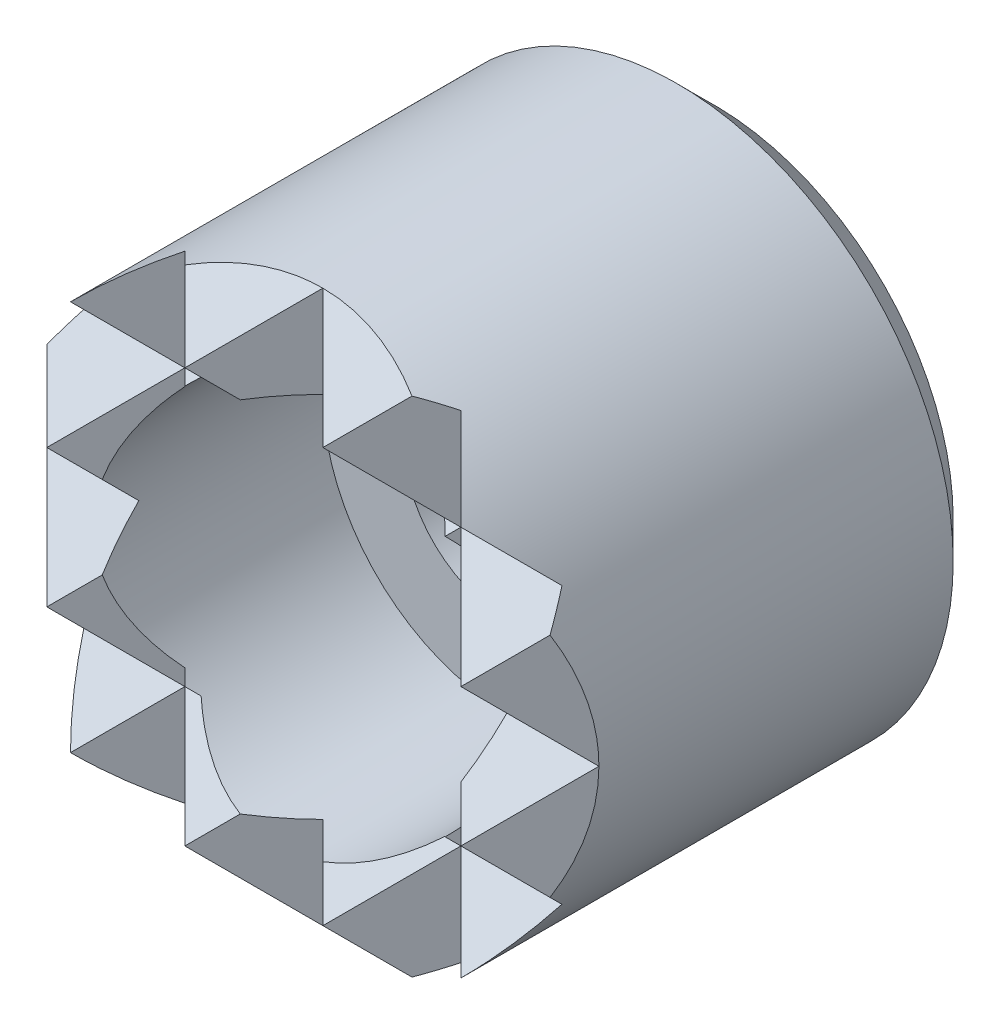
ISO-10303-21;
HEADER;
FILE_DESCRIPTION(('STEP AP214'),'2;1');
FILE_NAME('part.step','',(''),(''),'','','');
FILE_SCHEMA(('AUTOMOTIVE_DESIGN { 1 0 10303 214 1 1 1 1 }'));
ENDSEC;
DATA;
#1=APPLICATION_CONTEXT('core data for automotive mechanical design processes');
#2=APPLICATION_PROTOCOL_DEFINITION('international standard','automotive_design',2000,#1);
#3=PRODUCT_CONTEXT('',#1,'mechanical');
#4=PRODUCT('Part','Part','',(#3));
#5=PRODUCT_RELATED_PRODUCT_CATEGORY('part','',(#4));
#6=PRODUCT_DEFINITION_FORMATION('','',#4);
#7=PRODUCT_DEFINITION_CONTEXT('part definition',#1,'design');
#8=PRODUCT_DEFINITION('design','',#6,#7);
#9=PRODUCT_DEFINITION_SHAPE('','',#8);
#10=(LENGTH_UNIT() NAMED_UNIT(*) SI_UNIT(.MILLI.,.METRE.));
#11=(NAMED_UNIT(*) PLANE_ANGLE_UNIT() SI_UNIT($,.RADIAN.));
#12=(NAMED_UNIT(*) SI_UNIT($,.STERADIAN.) SOLID_ANGLE_UNIT());
#13=UNCERTAINTY_MEASURE_WITH_UNIT(LENGTH_MEASURE(1.E-05),#10,'distance_accuracy_value','');
#14=(GEOMETRIC_REPRESENTATION_CONTEXT(3) GLOBAL_UNCERTAINTY_ASSIGNED_CONTEXT((#13)) GLOBAL_UNIT_ASSIGNED_CONTEXT((#10,
#11,#12)) REPRESENTATION_CONTEXT('',''));
#15=CARTESIAN_POINT('',(0.,0.,0.));
#16=DIRECTION('',(0.,0.,1.));
#17=DIRECTION('',(1.,0.,0.));
#18=AXIS2_PLACEMENT_3D('',#15,#16,#17);
#19=CARTESIAN_POINT('',(-10.,-4.5,10.));
#20=DIRECTION('',(0.,0.707106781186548,-0.707106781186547));
#21=DIRECTION('',(0.,0.707106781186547,0.707106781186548));
#22=AXIS2_PLACEMENT_3D('',#19,#20,#21);
#23=PLANE('',#22);
#24=DIRECTION('',(-0.577350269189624,0.577350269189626,0.577350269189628));
#25=VECTOR('',#24,1.);
#26=CARTESIAN_POINT('',(-4.33333333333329,-1.66666666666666,12.8333333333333));
#27=LINE('',#26,#25);
#28=CARTESIAN_POINT('',(0.,-6.,8.5));
#29=VERTEX_POINT('',#28);
#30=CARTESIAN_POINT('',(-1.49999999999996,-4.5,10.));
#31=VERTEX_POINT('',#30);
#32=EDGE_CURVE('E270',#29,#31,#27,.T.);
#33=ORIENTED_EDGE('',*,*,#32,.T.);
#34=DIRECTION('',(-0.577350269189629,-0.577350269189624,-0.577350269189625));
#35=VECTOR('',#34,1.);
#36=CARTESIAN_POINT('',(-4.33333333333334,-7.33333333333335,7.16666666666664));
#37=LINE('',#36,#35);
#38=CARTESIAN_POINT('',(-2.46862696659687,-5.46862696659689,9.03137303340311));
#39=VERTEX_POINT('',#38);
#40=EDGE_CURVE('E249',#31,#39,#37,.T.);
#41=ORIENTED_EDGE('',*,*,#40,.T.);
#42=CARTESIAN_POINT('',(0.,0.,14.5));
#43=DIRECTION('',(0.,0.707106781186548,-0.707106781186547));
#44=DIRECTION('',(0.,-0.707106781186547,-0.707106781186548));
#45=AXIS2_PLACEMENT_3D('',#42,#43,#44);
#46=ELLIPSE('',#45,8.48528137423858,6.);
#47=EDGE_CURVE('E241',#29,#39,#46,.T.);
#48=ORIENTED_EDGE('',*,*,#47,.F.);
#49=EDGE_LOOP('',(#33,#41,#48));
#50=FACE_BOUND('',#49,.T.);
#51=ADVANCED_FACE('F14',(#50),#23,.F.);
#52=CARTESIAN_POINT('',(-10.,6.,8.5));
#53=DIRECTION('',(0.,-0.707106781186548,-0.707106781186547));
#54=DIRECTION('',(0.,0.707106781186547,-0.707106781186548));
#55=AXIS2_PLACEMENT_3D('',#52,#53,#54);
#56=PLANE('',#55);
#57=CARTESIAN_POINT('',(0.,0.,14.5));
#58=DIRECTION('',(0.,-0.707106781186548,-0.707106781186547));
#59=DIRECTION('',(0.,0.707106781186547,-0.707106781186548));
#60=AXIS2_PLACEMENT_3D('',#57,#58,#59);
#61=ELLIPSE('',#60,8.48528137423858,6.);
#62=CARTESIAN_POINT('',(-2.46862696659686,5.46862696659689,9.03137303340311));
#63=VERTEX_POINT('',#62);
#64=CARTESIAN_POINT('',(0.,6.,8.5));
#65=VERTEX_POINT('',#64);
#66=EDGE_CURVE('E442',#63,#65,#61,.T.);
#67=ORIENTED_EDGE('',*,*,#66,.F.);
#68=DIRECTION('',(0.577350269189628,-0.577350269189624,0.577350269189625));
#69=VECTOR('',#68,1.);
#70=CARTESIAN_POINT('',(-5.33333333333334,8.33333333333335,6.16666666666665));
#71=LINE('',#70,#69);
#72=CARTESIAN_POINT('',(-1.49999999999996,4.5,10.));
#73=VERTEX_POINT('',#72);
#74=EDGE_CURVE('E258',#63,#73,#71,.T.);
#75=ORIENTED_EDGE('',*,*,#74,.T.);
#76=DIRECTION('',(0.577350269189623,0.577350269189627,-0.577350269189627));
#77=VECTOR('',#76,1.);
#78=CARTESIAN_POINT('',(-3.33333333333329,2.66666666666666,11.8333333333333));
#79=LINE('',#78,#77);
#80=EDGE_CURVE('E278',#73,#65,#79,.T.);
#81=ORIENTED_EDGE('',*,*,#80,.T.);
#82=EDGE_LOOP('',(#67,#75,#81));
#83=FACE_BOUND('',#82,.T.);
#84=ADVANCED_FACE('F519',(#83),#56,.F.);
#85=CARTESIAN_POINT('',(-10.,3.,8.5));
#86=DIRECTION('',(0.,-0.707106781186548,-0.707106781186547));
#87=DIRECTION('',(0.,0.707106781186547,-0.707106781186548));
#88=AXIS2_PLACEMENT_3D('',#85,#86,#87);
#89=PLANE('',#88);
#90=CARTESIAN_POINT('',(0.,0.,11.5));
#91=DIRECTION('',(0.,-0.707106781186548,-0.707106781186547));
#92=DIRECTION('',(0.,-0.707106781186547,0.707106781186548));
#93=AXIS2_PLACEMENT_3D('',#90,#91,#92);
#94=ELLIPSE('',#93,5.65685424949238,4.);
#95=CARTESIAN_POINT('',(2.64575131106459,3.,8.5));
#96=VERTEX_POINT('',#95);
#97=CARTESIAN_POINT('',(2.82842712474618,2.8284271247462,8.6715728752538));
#98=VERTEX_POINT('',#97);
#99=EDGE_CURVE('E415',#96,#98,#94,.T.);
#100=ORIENTED_EDGE('',*,*,#99,.T.);
#101=DIRECTION('',(0.577350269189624,0.577350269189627,-0.577350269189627));
#102=VECTOR('',#101,1.);
#103=CARTESIAN_POINT('',(-1.33333333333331,-1.33333333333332,12.8333333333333));
#104=LINE('',#103,#102);
#105=CARTESIAN_POINT('',(3.,3.,8.5));
#106=VERTEX_POINT('',#105);
#107=EDGE_CURVE('E311',#98,#106,#104,.T.);
#108=ORIENTED_EDGE('',*,*,#107,.T.);
#109=DIRECTION('',(1.,0.,0.));
#110=VECTOR('',#109,1.);
#111=CARTESIAN_POINT('',(-10.,3.,8.5));
#112=LINE('',#111,#110);
#113=EDGE_CURVE('E398',#96,#106,#112,.T.);
#114=ORIENTED_EDGE('',*,*,#113,.F.);
#115=EDGE_LOOP('',(#100,#108,#114));
#116=FACE_BOUND('',#115,.T.);
#117=ADVANCED_FACE('F414',(#116),#89,.F.);
#118=CARTESIAN_POINT('',(-2.99999999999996,3.,8.5));
#119=VERTEX_POINT('',#118);
#120=CARTESIAN_POINT('',(-2.64575131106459,3.,8.5));
#121=VERTEX_POINT('',#120);
#122=EDGE_CURVE('E401',#119,#121,#112,.T.);
#123=ORIENTED_EDGE('',*,*,#122,.F.);
#124=DIRECTION('',(0.577350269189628,-0.577350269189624,0.577350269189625));
#125=VECTOR('',#124,1.);
#126=CARTESIAN_POINT('',(-5.33333333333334,5.33333333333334,6.16666666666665));
#127=LINE('',#126,#125);
#128=CARTESIAN_POINT('',(-2.82842712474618,2.8284271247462,8.6715728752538));
#129=VERTEX_POINT('',#128);
#130=EDGE_CURVE('E265',#119,#129,#127,.T.);
#131=ORIENTED_EDGE('',*,*,#130,.T.);
#132=EDGE_CURVE('E417',#129,#121,#94,.T.);
#133=ORIENTED_EDGE('',*,*,#132,.T.);
#134=EDGE_LOOP('',(#123,#131,#133));
#135=FACE_BOUND('',#134,.T.);
#136=ADVANCED_FACE('F660',(#135),#89,.F.);
#137=CARTESIAN_POINT('',(-10.,-1.5,10.));
#138=DIRECTION('',(0.,0.707106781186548,-0.707106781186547));
#139=DIRECTION('',(0.,0.707106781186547,0.707106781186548));
#140=AXIS2_PLACEMENT_3D('',#137,#138,#139);
#141=PLANE('',#140);
#142=CARTESIAN_POINT('',(0.,0.,11.5));
#143=DIRECTION('',(0.,0.707106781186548,-0.707106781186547));
#144=DIRECTION('',(0.,0.707106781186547,0.707106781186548));
#145=AXIS2_PLACEMENT_3D('',#142,#143,#144);
#146=ELLIPSE('',#145,5.65685424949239,4.);
#147=CARTESIAN_POINT('',(-2.64575131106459,-3.,8.5));
#148=VERTEX_POINT('',#147);
#149=CARTESIAN_POINT('',(-2.82842712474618,-2.82842712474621,8.67157287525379));
#150=VERTEX_POINT('',#149);
#151=EDGE_CURVE('E432',#148,#150,#146,.T.);
#152=ORIENTED_EDGE('',*,*,#151,.T.);
#153=DIRECTION('',(-0.577350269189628,-0.577350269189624,-0.577350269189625));
#154=VECTOR('',#153,1.);
#155=CARTESIAN_POINT('',(-4.33333333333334,-4.33333333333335,7.16666666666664));
#156=LINE('',#155,#154);
#157=CARTESIAN_POINT('',(-3.,-3.,8.5));
#158=VERTEX_POINT('',#157);
#159=EDGE_CURVE('E257',#150,#158,#156,.T.);
#160=ORIENTED_EDGE('',*,*,#159,.T.);
#161=DIRECTION('',(1.,0.,0.));
#162=VECTOR('',#161,1.);
#163=CARTESIAN_POINT('',(-10.,-3.,8.5));
#164=LINE('',#163,#162);
#165=EDGE_CURVE('E494',#158,#148,#164,.T.);
#166=ORIENTED_EDGE('',*,*,#165,.T.);
#167=EDGE_LOOP('',(#152,#160,#166));
#168=FACE_BOUND('',#167,.T.);
#169=ADVANCED_FACE('F538',(#168),#141,.F.);
#170=CARTESIAN_POINT('',(2.64575131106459,-3.,8.5));
#171=VERTEX_POINT('',#170);
#172=CARTESIAN_POINT('',(3.,-3.,8.5));
#173=VERTEX_POINT('',#172);
#174=EDGE_CURVE('E491',#171,#173,#164,.T.);
#175=ORIENTED_EDGE('',*,*,#174,.T.);
#176=DIRECTION('',(-0.577350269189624,0.577350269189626,0.577350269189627));
#177=VECTOR('',#176,1.);
#178=CARTESIAN_POINT('',(-2.33333333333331,2.33333333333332,13.8333333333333));
#179=LINE('',#178,#177);
#180=CARTESIAN_POINT('',(2.82842712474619,-2.8284271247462,8.6715728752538));
#181=VERTEX_POINT('',#180);
#182=EDGE_CURVE('E297',#173,#181,#179,.T.);
#183=ORIENTED_EDGE('',*,*,#182,.T.);
#184=EDGE_CURVE('E435',#181,#171,#146,.T.);
#185=ORIENTED_EDGE('',*,*,#184,.T.);
#186=EDGE_LOOP('',(#175,#183,#185));
#187=FACE_BOUND('',#186,.T.);
#188=ADVANCED_FACE('F497',(#187),#141,.F.);
#189=CARTESIAN_POINT('',(-10.,-3.,8.5));
#190=DIRECTION('',(0.,-0.707106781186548,-0.707106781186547));
#191=DIRECTION('',(0.,0.707106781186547,-0.707106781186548));
#192=AXIS2_PLACEMENT_3D('',#189,#190,#191);
#193=PLANE('',#192);
#194=CARTESIAN_POINT('',(0.,0.,5.5));
#195=DIRECTION('',(0.,-0.707106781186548,-0.707106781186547));
#196=DIRECTION('',(0.,-0.707106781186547,0.707106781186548));
#197=AXIS2_PLACEMENT_3D('',#194,#195,#196);
#198=ELLIPSE('',#197,5.65685424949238,4.);
#199=CARTESIAN_POINT('',(0.89791576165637,-3.89791576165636,9.39791576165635));
#200=VERTEX_POINT('',#199);
#201=EDGE_CURVE('E436',#171,#200,#198,.T.);
#202=ORIENTED_EDGE('',*,*,#201,.T.);
#203=DIRECTION('',(0.57735026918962,-0.577350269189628,0.577350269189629));
#204=VECTOR('',#203,1.);
#205=CARTESIAN_POINT('',(-3.33333333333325,0.333333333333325,5.16666666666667));
#206=LINE('',#205,#204);
#207=CARTESIAN_POINT('',(1.5,-4.5,10.));
#208=VERTEX_POINT('',#207);
#209=EDGE_CURVE('E285',#200,#208,#206,.T.);
#210=ORIENTED_EDGE('',*,*,#209,.T.);
#211=DIRECTION('',(0.577350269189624,0.577350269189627,-0.577350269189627));
#212=VECTOR('',#211,1.);
#213=CARTESIAN_POINT('',(-1.33333333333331,-7.33333333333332,12.8333333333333));
#214=LINE('',#213,#212);
#215=EDGE_CURVE('E300',#208,#173,#214,.T.);
#216=ORIENTED_EDGE('',*,*,#215,.T.);
#217=ORIENTED_EDGE('',*,*,#174,.F.);
#218=EDGE_LOOP('',(#202,#210,#216,#217));
#219=FACE_BOUND('',#218,.T.);
#220=ADVANCED_FACE('F500',(#219),#193,.F.);
#221=CARTESIAN_POINT('',(5.19615242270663,-3.,8.5));
#222=VERTEX_POINT('',#221);
#223=EDGE_CURVE('E489',#173,#222,#164,.T.);
#224=ORIENTED_EDGE('',*,*,#223,.F.);
#225=DIRECTION('',(0.577350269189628,-0.577350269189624,0.577350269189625));
#226=VECTOR('',#225,1.);
#227=CARTESIAN_POINT('',(-1.33333333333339,1.33333333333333,4.16666666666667));
#228=LINE('',#227,#226);
#229=CARTESIAN_POINT('',(4.24264068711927,-4.24264068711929,9.74264068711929));
#230=VERTEX_POINT('',#229);
#231=EDGE_CURVE('E322',#173,#230,#228,.T.);
#232=ORIENTED_EDGE('',*,*,#231,.T.);
#233=CARTESIAN_POINT('',(0.,0.,5.5));
#234=DIRECTION('',(0.,-0.707106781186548,-0.707106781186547));
#235=DIRECTION('',(0.,0.707106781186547,-0.707106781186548));
#236=AXIS2_PLACEMENT_3D('',#233,#234,#235);
#237=ELLIPSE('',#236,8.48528137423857,6.);
#238=EDGE_CURVE('E483',#222,#230,#237,.T.);
#239=ORIENTED_EDGE('',*,*,#238,.F.);
#240=EDGE_LOOP('',(#224,#232,#239));
#241=FACE_BOUND('',#240,.T.);
#242=ADVANCED_FACE('F488',(#241),#193,.F.);
#243=DIRECTION('',(0.577350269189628,-0.577350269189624,0.577350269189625));
#244=VECTOR('',#243,1.);
#245=CARTESIAN_POINT('',(-5.33333333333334,-0.666666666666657,6.16666666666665));
#246=LINE('',#245,#244);
#247=EDGE_CURVE('E231',#158,#31,#246,.T.);
#248=ORIENTED_EDGE('',*,*,#247,.T.);
#249=DIRECTION('',(0.577350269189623,0.577350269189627,-0.577350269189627));
#250=VECTOR('',#249,1.);
#251=CARTESIAN_POINT('',(-3.33333333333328,-6.33333333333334,11.8333333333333));
#252=LINE('',#251,#250);
#253=CARTESIAN_POINT('',(-0.897915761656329,-3.89791576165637,9.39791576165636));
#254=VERTEX_POINT('',#253);
#255=EDGE_CURVE('E273',#31,#254,#252,.T.);
#256=ORIENTED_EDGE('',*,*,#255,.T.);
#257=EDGE_CURVE('E440',#254,#148,#198,.T.);
#258=ORIENTED_EDGE('',*,*,#257,.T.);
#259=ORIENTED_EDGE('',*,*,#165,.F.);
#260=EDGE_LOOP('',(#248,#256,#258,#259));
#261=FACE_BOUND('',#260,.T.);
#262=ADVANCED_FACE('F532',(#261),#193,.F.);
#263=CARTESIAN_POINT('',(-10.,4.5,10.));
#264=DIRECTION('',(0.,0.707106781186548,-0.707106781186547));
#265=DIRECTION('',(0.,0.707106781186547,0.707106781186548));
#266=AXIS2_PLACEMENT_3D('',#263,#264,#265);
#267=PLANE('',#266);
#268=DIRECTION('',(-0.577350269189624,0.577350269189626,0.577350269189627));
#269=VECTOR('',#268,1.);
#270=CARTESIAN_POINT('',(-2.33333333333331,8.33333333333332,13.8333333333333));
#271=LINE('',#270,#269);
#272=CARTESIAN_POINT('',(1.5,4.5,10.));
#273=VERTEX_POINT('',#272);
#274=EDGE_CURVE('E388',#106,#273,#271,.T.);
#275=ORIENTED_EDGE('',*,*,#274,.T.);
#276=DIRECTION('',(-0.57735026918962,-0.577350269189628,-0.577350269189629));
#277=VECTOR('',#276,1.);
#278=CARTESIAN_POINT('',(-2.33333333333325,0.666666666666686,6.16666666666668));
#279=LINE('',#278,#277);
#280=CARTESIAN_POINT('',(0.897915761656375,3.89791576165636,9.39791576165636));
#281=VERTEX_POINT('',#280);
#282=EDGE_CURVE('E454',#273,#281,#279,.T.);
#283=ORIENTED_EDGE('',*,*,#282,.T.);
#284=CARTESIAN_POINT('',(0.,0.,5.5));
#285=DIRECTION('',(0.,0.707106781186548,-0.707106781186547));
#286=DIRECTION('',(0.,0.707106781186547,0.707106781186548));
#287=AXIS2_PLACEMENT_3D('',#284,#285,#286);
#288=ELLIPSE('',#287,5.65685424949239,4.);
#289=EDGE_CURVE('E409',#281,#96,#288,.T.);
#290=ORIENTED_EDGE('',*,*,#289,.T.);
#291=ORIENTED_EDGE('',*,*,#113,.T.);
#292=EDGE_LOOP('',(#275,#283,#290,#291));
#293=FACE_BOUND('',#292,.T.);
#294=ADVANCED_FACE('F405',(#293),#267,.F.);
#295=CARTESIAN_POINT('',(0.,0.,5.5));
#296=DIRECTION('',(0.,0.707106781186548,-0.707106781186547));
#297=DIRECTION('',(0.,-0.707106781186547,-0.707106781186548));
#298=AXIS2_PLACEMENT_3D('',#295,#296,#297);
#299=ELLIPSE('',#298,8.48528137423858,6.);
#300=CARTESIAN_POINT('',(4.24264068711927,4.24264068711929,9.7426406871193));
#301=VERTEX_POINT('',#300);
#302=CARTESIAN_POINT('',(5.19615242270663,3.,8.5));
#303=VERTEX_POINT('',#302);
#304=EDGE_CURVE('E386',#301,#303,#299,.T.);
#305=ORIENTED_EDGE('',*,*,#304,.F.);
#306=DIRECTION('',(-0.577350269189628,-0.577350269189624,-0.577350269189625));
#307=VECTOR('',#306,1.);
#308=CARTESIAN_POINT('',(-0.333333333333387,-0.333333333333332,5.16666666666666));
#309=LINE('',#308,#307);
#310=EDGE_CURVE('E381',#301,#106,#309,.T.);
#311=ORIENTED_EDGE('',*,*,#310,.T.);
#312=EDGE_CURVE('E384',#106,#303,#112,.T.);
#313=ORIENTED_EDGE('',*,*,#312,.T.);
#314=EDGE_LOOP('',(#305,#311,#313));
#315=FACE_BOUND('',#314,.T.);
#316=ADVANCED_FACE('F383',(#315),#267,.F.);
#317=CARTESIAN_POINT('',(-0.897915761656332,3.89791576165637,9.39791576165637));
#318=VERTEX_POINT('',#317);
#319=EDGE_CURVE('E418',#121,#318,#288,.T.);
#320=ORIENTED_EDGE('',*,*,#319,.T.);
#321=DIRECTION('',(-0.577350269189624,0.577350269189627,0.577350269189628));
#322=VECTOR('',#321,1.);
#323=CARTESIAN_POINT('',(-4.33333333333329,7.33333333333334,12.8333333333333));
#324=LINE('',#323,#322);
#325=EDGE_CURVE('E389',#318,#73,#324,.T.);
#326=ORIENTED_EDGE('',*,*,#325,.T.);
#327=DIRECTION('',(-0.577350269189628,-0.577350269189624,-0.577350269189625));
#328=VECTOR('',#327,1.);
#329=CARTESIAN_POINT('',(-4.33333333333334,1.66666666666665,7.16666666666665));
#330=LINE('',#329,#328);
#331=EDGE_CURVE('E448',#73,#119,#330,.T.);
#332=ORIENTED_EDGE('',*,*,#331,.T.);
#333=ORIENTED_EDGE('',*,*,#122,.T.);
#334=EDGE_LOOP('',(#320,#326,#332,#333));
#335=FACE_BOUND('',#334,.T.);
#336=ADVANCED_FACE('F602',(#335),#267,.F.);
#337=CARTESIAN_POINT('',(0.,0.,0.));
#338=DIRECTION('',(0.,0.,1.));
#339=DIRECTION('',(1.,0.,0.));
#340=AXIS2_PLACEMENT_3D('',#337,#338,#339);
#341=PLANE('',#340);
#342=CARTESIAN_POINT('',(0.,0.,0.));
#343=DIRECTION('',(0.,0.,1.));
#344=DIRECTION('',(1.,0.,0.));
#345=AXIS2_PLACEMENT_3D('',#342,#343,#344);
#346=CIRCLE('',#345,5.2);
#347=CARTESIAN_POINT('',(5.2,0.,0.));
#348=VERTEX_POINT('',#347);
#349=EDGE_CURVE('E585',#348,#348,#346,.F.);
#350=ORIENTED_EDGE('',*,*,#349,.T.);
#351=EDGE_LOOP('',(#350));
#352=FACE_BOUND('',#351,.T.);
#353=CARTESIAN_POINT('',(0.,0.,0.));
#354=DIRECTION('',(0.,0.,1.));
#355=DIRECTION('',(1.,0.,0.));
#356=AXIS2_PLACEMENT_3D('',#353,#354,#355);
#357=CIRCLE('',#356,2.25);
#358=CARTESIAN_POINT('',(2.25,0.,0.));
#359=VERTEX_POINT('',#358);
#360=EDGE_CURVE('E580',#359,#359,#357,.F.);
#361=ORIENTED_EDGE('',*,*,#360,.F.);
#362=EDGE_LOOP('',(#361));
#363=FACE_BOUND('',#362,.T.);
#364=ADVANCED_FACE('F589',(#352,#363),#341,.F.);
#365=CARTESIAN_POINT('',(0.,0.,10.));
#366=DIRECTION('',(0.,0.,-1.));
#367=DIRECTION('',(-1.,0.,0.));
#368=AXIS2_PLACEMENT_3D('',#365,#366,#367);
#369=CYLINDRICAL_SURFACE('',#368,6.);
#370=CARTESIAN_POINT('',(0.,0.,0.8));
#371=DIRECTION('',(0.,0.,1.));
#372=DIRECTION('',(1.,0.,0.));
#373=AXIS2_PLACEMENT_3D('',#370,#371,#372);
#374=CIRCLE('',#373,6.);
#375=CARTESIAN_POINT('',(6.,0.,0.8));
#376=VERTEX_POINT('',#375);
#377=EDGE_CURVE('E583',#376,#376,#374,.T.);
#378=ORIENTED_EDGE('',*,*,#377,.T.);
#379=EDGE_LOOP('',(#378));
#380=FACE_BOUND('',#379,.T.);
#381=CARTESIAN_POINT('',(2.46862696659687,5.46862696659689,9.03137303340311));
#382=VERTEX_POINT('',#381);
#383=EDGE_CURVE('E439',#65,#382,#61,.T.);
#384=ORIENTED_EDGE('',*,*,#383,.T.);
#385=CARTESIAN_POINT('',(0.,0.,11.5));
#386=DIRECTION('',(-0.70710678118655,0.,-0.707106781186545));
#387=DIRECTION('',(0.707106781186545,0.,-0.70710678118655));
#388=AXIS2_PLACEMENT_3D('',#385,#386,#387);
#389=ELLIPSE('',#388,8.4852813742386,6.);
#390=CARTESIAN_POINT('',(3.,5.19615242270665,8.5));
#391=VERTEX_POINT('',#390);
#392=EDGE_CURVE('E303',#382,#391,#389,.T.);
#393=ORIENTED_EDGE('',*,*,#392,.T.);
#394=CARTESIAN_POINT('',(0.,0.,5.5));
#395=DIRECTION('',(0.707106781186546,0.,-0.70710678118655));
#396=DIRECTION('',(-0.70710678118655,0.,-0.707106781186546));
#397=AXIS2_PLACEMENT_3D('',#394,#395,#396);
#398=ELLIPSE('',#397,8.48528137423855,6.);
#399=EDGE_CURVE('E330',#391,#301,#398,.T.);
#400=ORIENTED_EDGE('',*,*,#399,.T.);
#401=ORIENTED_EDGE('',*,*,#304,.T.);
#402=CARTESIAN_POINT('',(0.,0.,11.5));
#403=DIRECTION('',(0.,-0.707106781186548,-0.707106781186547));
#404=DIRECTION('',(0.,0.707106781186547,-0.707106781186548));
#405=AXIS2_PLACEMENT_3D('',#402,#403,#404);
#406=ELLIPSE('',#405,8.48528137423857,6.);
#407=CARTESIAN_POINT('',(5.46862696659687,2.46862696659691,9.03137303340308));
#408=VERTEX_POINT('',#407);
#409=EDGE_CURVE('E397',#303,#408,#406,.T.);
#410=ORIENTED_EDGE('',*,*,#409,.T.);
#411=CARTESIAN_POINT('',(0.,0.,14.5));
#412=DIRECTION('',(-0.70710678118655,0.,-0.707106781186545));
#413=DIRECTION('',(0.707106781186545,0.,-0.70710678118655));
#414=AXIS2_PLACEMENT_3D('',#411,#412,#413);
#415=ELLIPSE('',#414,8.4852813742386,6.);
#416=CARTESIAN_POINT('',(6.,0.,8.5));
#417=VERTEX_POINT('',#416);
#418=EDGE_CURVE('E548',#408,#417,#415,.T.);
#419=ORIENTED_EDGE('',*,*,#418,.T.);
#420=CARTESIAN_POINT('',(5.46862696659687,-2.46862696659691,9.03137303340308));
#421=VERTEX_POINT('',#420);
#422=EDGE_CURVE('E551',#417,#421,#415,.T.);
#423=ORIENTED_EDGE('',*,*,#422,.T.);
#424=CARTESIAN_POINT('',(0.,0.,11.5));
#425=DIRECTION('',(0.,0.707106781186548,-0.707106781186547));
#426=DIRECTION('',(0.,-0.707106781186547,-0.707106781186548));
#427=AXIS2_PLACEMENT_3D('',#424,#425,#426);
#428=ELLIPSE('',#427,8.48528137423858,6.);
#429=EDGE_CURVE('E462',#421,#222,#428,.T.);
#430=ORIENTED_EDGE('',*,*,#429,.T.);
#431=ORIENTED_EDGE('',*,*,#238,.T.);
#432=CARTESIAN_POINT('',(3.,-5.19615242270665,8.5));
#433=VERTEX_POINT('',#432);
#434=EDGE_CURVE('E314',#230,#433,#398,.T.);
#435=ORIENTED_EDGE('',*,*,#434,.T.);
#436=CARTESIAN_POINT('',(2.46862696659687,-5.46862696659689,9.03137303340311));
#437=VERTEX_POINT('',#436);
#438=EDGE_CURVE('E292',#433,#437,#389,.T.);
#439=ORIENTED_EDGE('',*,*,#438,.T.);
#440=EDGE_CURVE('E444',#437,#29,#46,.T.);
#441=ORIENTED_EDGE('',*,*,#440,.T.);
#442=ORIENTED_EDGE('',*,*,#47,.T.);
#443=CARTESIAN_POINT('',(0.,0.,11.5));
#444=DIRECTION('',(0.707106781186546,0.,-0.70710678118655));
#445=DIRECTION('',(-0.70710678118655,0.,-0.707106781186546));
#446=AXIS2_PLACEMENT_3D('',#443,#444,#445);
#447=ELLIPSE('',#446,8.48528137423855,6.);
#448=CARTESIAN_POINT('',(-3.,-5.19615242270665,8.5));
#449=VERTEX_POINT('',#448);
#450=EDGE_CURVE('E228',#39,#449,#447,.T.);
#451=ORIENTED_EDGE('',*,*,#450,.T.);
#452=CARTESIAN_POINT('',(0.,0.,5.5));
#453=DIRECTION('',(-0.70710678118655,0.,-0.707106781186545));
#454=DIRECTION('',(0.707106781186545,0.,-0.70710678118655));
#455=AXIS2_PLACEMENT_3D('',#452,#453,#454);
#456=ELLIPSE('',#455,8.4852813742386,6.);
#457=CARTESIAN_POINT('',(-4.24264068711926,-4.24264068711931,9.74264068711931));
#458=VERTEX_POINT('',#457);
#459=EDGE_CURVE('E211',#449,#458,#456,.T.);
#460=ORIENTED_EDGE('',*,*,#459,.T.);
#461=CARTESIAN_POINT('',(-5.19615242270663,-3.,8.5));
#462=VERTEX_POINT('',#461);
#463=EDGE_CURVE('E568',#458,#462,#237,.T.);
#464=ORIENTED_EDGE('',*,*,#463,.T.);
#465=CARTESIAN_POINT('',(-5.46862696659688,-2.46862696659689,9.03137303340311));
#466=VERTEX_POINT('',#465);
#467=EDGE_CURVE('E571',#462,#466,#428,.T.);
#468=ORIENTED_EDGE('',*,*,#467,.T.);
#469=CARTESIAN_POINT('',(0.,0.,14.5));
#470=DIRECTION('',(0.707106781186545,0.,-0.70710678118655));
#471=DIRECTION('',(-0.70710678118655,0.,-0.707106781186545));
#472=AXIS2_PLACEMENT_3D('',#469,#470,#471);
#473=ELLIPSE('',#472,8.48528137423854,6.);
#474=CARTESIAN_POINT('',(-6.,0.,8.5));
#475=VERTEX_POINT('',#474);
#476=EDGE_CURVE('E559',#466,#475,#473,.T.);
#477=ORIENTED_EDGE('',*,*,#476,.T.);
#478=CARTESIAN_POINT('',(-5.46862696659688,2.46862696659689,9.03137303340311));
#479=VERTEX_POINT('',#478);
#480=EDGE_CURVE('E399',#475,#479,#473,.T.);
#481=ORIENTED_EDGE('',*,*,#480,.T.);
#482=CARTESIAN_POINT('',(-5.19615242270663,3.,8.5));
#483=VERTEX_POINT('',#482);
#484=EDGE_CURVE('E572',#479,#483,#406,.T.);
#485=ORIENTED_EDGE('',*,*,#484,.T.);
#486=CARTESIAN_POINT('',(-4.24264068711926,4.24264068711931,9.74264068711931));
#487=VERTEX_POINT('',#486);
#488=EDGE_CURVE('E567',#483,#487,#299,.T.);
#489=ORIENTED_EDGE('',*,*,#488,.T.);
#490=CARTESIAN_POINT('',(-3.,5.19615242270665,8.5));
#491=VERTEX_POINT('',#490);
#492=EDGE_CURVE('E224',#487,#491,#456,.T.);
#493=ORIENTED_EDGE('',*,*,#492,.T.);
#494=EDGE_CURVE('E245',#491,#63,#447,.T.);
#495=ORIENTED_EDGE('',*,*,#494,.T.);
#496=ORIENTED_EDGE('',*,*,#66,.T.);
#497=EDGE_LOOP('',(#384,#393,#400,#401,#410,#419,#423,#430,#431,#435,#439,#441,#442,#451,#460,
#464,#468,#477,#481,#485,#489,#493,#495,#496));
#498=FACE_BOUND('',#497,.T.);
#499=ADVANCED_FACE('F238',(#380,#498),#369,.T.);
#500=CARTESIAN_POINT('',(0.,0.,10.));
#501=DIRECTION('',(0.,0.,1.));
#502=DIRECTION('',(1.,0.,0.));
#503=AXIS2_PLACEMENT_3D('',#500,#501,#502);
#504=CYLINDRICAL_SURFACE('',#503,2.25);
#505=CARTESIAN_POINT('',(0.,0.,4.5));
#506=DIRECTION('',(0.,0.,1.));
#507=DIRECTION('',(1.,0.,0.));
#508=AXIS2_PLACEMENT_3D('',#505,#506,#507);
#509=CIRCLE('',#508,2.25);
#510=CARTESIAN_POINT('',(2.25,0.,4.5));
#511=VERTEX_POINT('',#510);
#512=EDGE_CURVE('E574',#511,#511,#509,.T.);
#513=ORIENTED_EDGE('',*,*,#512,.T.);
#514=EDGE_LOOP('',(#513));
#515=FACE_BOUND('',#514,.T.);
#516=ORIENTED_EDGE('',*,*,#360,.T.);
#517=EDGE_LOOP('',(#516));
#518=FACE_BOUND('',#517,.T.);
#519=ADVANCED_FACE('F595',(#515,#518),#504,.F.);
#520=CARTESIAN_POINT('',(0.,0.,10.));
#521=DIRECTION('',(0.,0.,1.));
#522=DIRECTION('',(1.,0.,0.));
#523=AXIS2_PLACEMENT_3D('',#520,#521,#522);
#524=CYLINDRICAL_SURFACE('',#523,4.);
#525=CARTESIAN_POINT('',(0.,0.,8.5));
#526=DIRECTION('',(-0.70710678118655,0.,-0.707106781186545));
#527=DIRECTION('',(-0.707106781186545,0.,0.70710678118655));
#528=AXIS2_PLACEMENT_3D('',#525,#526,#527);
#529=ELLIPSE('',#528,5.6568542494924,4.);
#530=CARTESIAN_POINT('',(0.,-4.,8.5));
#531=VERTEX_POINT('',#530);
#532=EDGE_CURVE('E269',#531,#254,#529,.T.);
#533=ORIENTED_EDGE('',*,*,#532,.F.);
#534=CARTESIAN_POINT('',(0.,0.,8.5));
#535=DIRECTION('',(0.707106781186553,0.,-0.707106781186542));
#536=DIRECTION('',(0.707106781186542,0.,0.707106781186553));
#537=AXIS2_PLACEMENT_3D('',#534,#535,#536);
#538=ELLIPSE('',#537,5.65685424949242,4.);
#539=EDGE_CURVE('E281',#200,#531,#538,.T.);
#540=ORIENTED_EDGE('',*,*,#539,.F.);
#541=ORIENTED_EDGE('',*,*,#201,.F.);
#542=ORIENTED_EDGE('',*,*,#184,.F.);
#543=CARTESIAN_POINT('',(0.,0.,11.5));
#544=DIRECTION('',(-0.70710678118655,0.,-0.707106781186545));
#545=DIRECTION('',(-0.707106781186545,0.,0.70710678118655));
#546=AXIS2_PLACEMENT_3D('',#543,#544,#545);
#547=ELLIPSE('',#546,5.6568542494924,4.);
#548=CARTESIAN_POINT('',(3.,-2.64575131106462,8.5));
#549=VERTEX_POINT('',#548);
#550=EDGE_CURVE('E296',#549,#181,#547,.T.);
#551=ORIENTED_EDGE('',*,*,#550,.F.);
#552=CARTESIAN_POINT('',(0.,0.,5.5));
#553=DIRECTION('',(0.707106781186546,0.,-0.70710678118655));
#554=DIRECTION('',(0.70710678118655,0.,0.707106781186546));
#555=AXIS2_PLACEMENT_3D('',#552,#553,#554);
#556=ELLIPSE('',#555,5.65685424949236,4.);
#557=CARTESIAN_POINT('',(3.89791576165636,-0.897915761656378,9.39791576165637));
#558=VERTEX_POINT('',#557);
#559=EDGE_CURVE('E318',#558,#549,#556,.T.);
#560=ORIENTED_EDGE('',*,*,#559,.F.);
#561=CARTESIAN_POINT('',(0.,0.,8.5));
#562=DIRECTION('',(0.,-0.707106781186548,-0.707106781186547));
#563=DIRECTION('',(0.,-0.707106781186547,0.707106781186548));
#564=AXIS2_PLACEMENT_3D('',#561,#562,#563);
#565=ELLIPSE('',#564,5.65685424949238,4.);
#566=CARTESIAN_POINT('',(4.,0.,8.5));
#567=VERTEX_POINT('',#566);
#568=EDGE_CURVE('E428',#567,#558,#565,.T.);
#569=ORIENTED_EDGE('',*,*,#568,.F.);
#570=CARTESIAN_POINT('',(0.,0.,8.5));
#571=DIRECTION('',(0.,0.707106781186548,-0.707106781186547));
#572=DIRECTION('',(0.,0.707106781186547,0.707106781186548));
#573=AXIS2_PLACEMENT_3D('',#570,#571,#572);
#574=ELLIPSE('',#573,5.65685424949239,4.);
#575=CARTESIAN_POINT('',(3.89791576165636,0.897915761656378,9.39791576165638));
#576=VERTEX_POINT('',#575);
#577=EDGE_CURVE('E427',#576,#567,#574,.T.);
#578=ORIENTED_EDGE('',*,*,#577,.F.);
#579=CARTESIAN_POINT('',(3.,2.64575131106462,8.5));
#580=VERTEX_POINT('',#579);
#581=EDGE_CURVE('E325',#580,#576,#556,.T.);
#582=ORIENTED_EDGE('',*,*,#581,.F.);
#583=EDGE_CURVE('E306',#98,#580,#547,.T.);
#584=ORIENTED_EDGE('',*,*,#583,.F.);
#585=ORIENTED_EDGE('',*,*,#99,.F.);
#586=ORIENTED_EDGE('',*,*,#289,.F.);
#587=CARTESIAN_POINT('',(0.,4.,8.5));
#588=VERTEX_POINT('',#587);
#589=EDGE_CURVE('E288',#588,#281,#538,.T.);
#590=ORIENTED_EDGE('',*,*,#589,.F.);
#591=EDGE_CURVE('E276',#318,#588,#529,.T.);
#592=ORIENTED_EDGE('',*,*,#591,.F.);
#593=ORIENTED_EDGE('',*,*,#319,.F.);
#594=ORIENTED_EDGE('',*,*,#132,.F.);
#595=CARTESIAN_POINT('',(0.,0.,11.5));
#596=DIRECTION('',(0.707106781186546,0.,-0.70710678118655));
#597=DIRECTION('',(0.70710678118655,0.,0.707106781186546));
#598=AXIS2_PLACEMENT_3D('',#595,#596,#597);
#599=ELLIPSE('',#598,5.65685424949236,4.);
#600=CARTESIAN_POINT('',(-3.,2.64575131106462,8.5));
#601=VERTEX_POINT('',#600);
#602=EDGE_CURVE('E251',#601,#129,#599,.T.);
#603=ORIENTED_EDGE('',*,*,#602,.F.);
#604=CARTESIAN_POINT('',(0.,0.,5.5));
#605=DIRECTION('',(-0.70710678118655,0.,-0.707106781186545));
#606=DIRECTION('',(-0.707106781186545,0.,0.70710678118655));
#607=AXIS2_PLACEMENT_3D('',#604,#605,#606);
#608=ELLIPSE('',#607,5.6568542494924,4.);
#609=CARTESIAN_POINT('',(-3.89791576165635,0.897915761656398,9.3979157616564));
#610=VERTEX_POINT('',#609);
#611=EDGE_CURVE('E340',#610,#601,#608,.T.);
#612=ORIENTED_EDGE('',*,*,#611,.F.);
#613=CARTESIAN_POINT('',(-4.,0.,8.5));
#614=VERTEX_POINT('',#613);
#615=EDGE_CURVE('E420',#614,#610,#574,.T.);
#616=ORIENTED_EDGE('',*,*,#615,.F.);
#617=CARTESIAN_POINT('',(-3.89791576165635,-0.897915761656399,9.3979157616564));
#618=VERTEX_POINT('',#617);
#619=EDGE_CURVE('E431',#618,#614,#565,.T.);
#620=ORIENTED_EDGE('',*,*,#619,.F.);
#621=CARTESIAN_POINT('',(-3.,-2.64575131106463,8.5));
#622=VERTEX_POINT('',#621);
#623=EDGE_CURVE('E222',#622,#618,#608,.T.);
#624=ORIENTED_EDGE('',*,*,#623,.F.);
#625=EDGE_CURVE('E243',#150,#622,#599,.T.);
#626=ORIENTED_EDGE('',*,*,#625,.F.);
#627=ORIENTED_EDGE('',*,*,#151,.F.);
#628=ORIENTED_EDGE('',*,*,#257,.F.);
#629=EDGE_LOOP('',(#533,#540,#541,#542,#551,#560,#569,#578,#582,#584,#585,#586,#590,#592,#593,
#594,#603,#612,#616,#620,#624,#626,#627,#628));
#630=FACE_BOUND('',#629,.T.);
#631=CARTESIAN_POINT('',(0.,0.,4.5));
#632=DIRECTION('',(0.,0.,1.));
#633=DIRECTION('',(1.,0.,0.));
#634=AXIS2_PLACEMENT_3D('',#631,#632,#633);
#635=CIRCLE('',#634,4.);
#636=CARTESIAN_POINT('',(4.,0.,4.5));
#637=VERTEX_POINT('',#636);
#638=EDGE_CURVE('E577',#637,#637,#635,.T.);
#639=ORIENTED_EDGE('',*,*,#638,.F.);
#640=EDGE_LOOP('',(#639));
#641=FACE_BOUND('',#640,.T.);
#642=ADVANCED_FACE('F474',(#630,#641),#524,.F.);
#643=CARTESIAN_POINT('',(2.25,0.,4.5));
#644=DIRECTION('',(0.,0.,1.));
#645=DIRECTION('',(1.,0.,0.));
#646=AXIS2_PLACEMENT_3D('',#643,#644,#645);
#647=PLANE('',#646);
#648=ORIENTED_EDGE('',*,*,#638,.T.);
#649=EDGE_LOOP('',(#648));
#650=FACE_BOUND('',#649,.T.);
#651=ORIENTED_EDGE('',*,*,#512,.F.);
#652=EDGE_LOOP('',(#651));
#653=FACE_BOUND('',#652,.T.);
#654=ADVANCED_FACE('F520',(#650,#653),#647,.T.);
#655=CARTESIAN_POINT('',(0.,0.,0.8));
#656=DIRECTION('',(0.,0.,1.));
#657=DIRECTION('',(1.,0.,0.));
#658=AXIS2_PLACEMENT_3D('',#655,#656,#657);
#659=CONICAL_SURFACE('',#658,6.,0.78539816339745);
#660=ORIENTED_EDGE('',*,*,#349,.F.);
#661=EDGE_LOOP('',(#660));
#662=FACE_BOUND('',#661,.T.);
#663=ORIENTED_EDGE('',*,*,#377,.F.);
#664=EDGE_LOOP('',(#663));
#665=FACE_BOUND('',#664,.T.);
#666=ADVANCED_FACE('F16',(#662,#665),#659,.T.);
#667=DIRECTION('',(-0.577350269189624,0.577350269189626,0.577350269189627));
#668=VECTOR('',#667,1.);
#669=CARTESIAN_POINT('',(-2.33333333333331,-0.66666666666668,13.8333333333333));
#670=LINE('',#669,#668);
#671=EDGE_CURVE('E293',#437,#208,#670,.T.);
#672=ORIENTED_EDGE('',*,*,#671,.T.);
#673=DIRECTION('',(-0.577350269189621,-0.577350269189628,-0.577350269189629));
#674=VECTOR('',#673,1.);
#675=CARTESIAN_POINT('',(-2.33333333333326,-8.33333333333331,6.16666666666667));
#676=LINE('',#675,#674);
#677=EDGE_CURVE('E282',#208,#29,#676,.T.);
#678=ORIENTED_EDGE('',*,*,#677,.T.);
#679=ORIENTED_EDGE('',*,*,#440,.F.);
#680=EDGE_LOOP('',(#672,#678,#679));
#681=FACE_BOUND('',#680,.T.);
#682=ADVANCED_FACE('F508',(#681),#23,.F.);
#683=ORIENTED_EDGE('',*,*,#383,.F.);
#684=DIRECTION('',(0.57735026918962,-0.577350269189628,0.577350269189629));
#685=VECTOR('',#684,1.);
#686=CARTESIAN_POINT('',(-3.33333333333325,9.33333333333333,5.16666666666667));
#687=LINE('',#686,#685);
#688=EDGE_CURVE('E290',#65,#273,#687,.T.);
#689=ORIENTED_EDGE('',*,*,#688,.T.);
#690=DIRECTION('',(0.577350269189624,0.577350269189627,-0.577350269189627));
#691=VECTOR('',#690,1.);
#692=CARTESIAN_POINT('',(-1.33333333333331,1.66666666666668,12.8333333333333));
#693=LINE('',#692,#691);
#694=EDGE_CURVE('E308',#273,#382,#693,.T.);
#695=ORIENTED_EDGE('',*,*,#694,.T.);
#696=EDGE_LOOP('',(#683,#689,#695));
#697=FACE_BOUND('',#696,.T.);
#698=ADVANCED_FACE('F510',(#697),#56,.F.);
#699=ORIENTED_EDGE('',*,*,#312,.F.);
#700=DIRECTION('',(0.577350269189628,-0.577350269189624,0.577350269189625));
#701=VECTOR('',#700,1.);
#702=CARTESIAN_POINT('',(-1.33333333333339,7.33333333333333,4.16666666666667));
#703=LINE('',#702,#701);
#704=CARTESIAN_POINT('',(4.5,1.49999999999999,10.));
#705=VERTEX_POINT('',#704);
#706=EDGE_CURVE('E221',#106,#705,#703,.T.);
#707=ORIENTED_EDGE('',*,*,#706,.T.);
#708=DIRECTION('',(0.577350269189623,0.577350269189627,-0.577350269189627));
#709=VECTOR('',#708,1.);
#710=CARTESIAN_POINT('',(0.66666666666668,-2.33333333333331,13.8333333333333));
#711=LINE('',#710,#709);
#712=EDGE_CURVE('E546',#705,#408,#711,.T.);
#713=ORIENTED_EDGE('',*,*,#712,.T.);
#714=ORIENTED_EDGE('',*,*,#409,.F.);
#715=EDGE_LOOP('',(#699,#707,#713,#714));
#716=FACE_BOUND('',#715,.T.);
#717=ADVANCED_FACE('F393',(#716),#89,.F.);
#718=ORIENTED_EDGE('',*,*,#484,.F.);
#719=DIRECTION('',(0.577350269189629,-0.577350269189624,0.577350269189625));
#720=VECTOR('',#719,1.);
#721=CARTESIAN_POINT('',(-7.33333333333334,4.33333333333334,7.16666666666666));
#722=LINE('',#721,#720);
#723=CARTESIAN_POINT('',(-4.5,1.5,10.));
#724=VERTEX_POINT('',#723);
#725=EDGE_CURVE('E556',#479,#724,#722,.T.);
#726=ORIENTED_EDGE('',*,*,#725,.T.);
#727=DIRECTION('',(0.577350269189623,0.577350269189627,-0.577350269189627));
#728=VECTOR('',#727,1.);
#729=CARTESIAN_POINT('',(-5.33333333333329,0.666666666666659,10.8333333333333));
#730=LINE('',#729,#728);
#731=EDGE_CURVE('E345',#724,#119,#730,.T.);
#732=ORIENTED_EDGE('',*,*,#731,.T.);
#733=EDGE_CURVE('E413',#483,#119,#112,.T.);
#734=ORIENTED_EDGE('',*,*,#733,.F.);
#735=EDGE_LOOP('',(#718,#726,#732,#734));
#736=FACE_BOUND('',#735,.T.);
#737=ADVANCED_FACE('F612',(#736),#89,.F.);
#738=CARTESIAN_POINT('',(-10.,1.5,10.));
#739=DIRECTION('',(0.,0.707106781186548,-0.707106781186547));
#740=DIRECTION('',(0.,0.707106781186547,0.707106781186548));
#741=AXIS2_PLACEMENT_3D('',#738,#739,#740);
#742=PLANE('',#741);
#743=DIRECTION('',(-0.577350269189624,0.577350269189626,0.577350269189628));
#744=VECTOR('',#743,1.);
#745=CARTESIAN_POINT('',(-6.33333333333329,3.33333333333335,11.8333333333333));
#746=LINE('',#745,#744);
#747=EDGE_CURVE('E342',#610,#724,#746,.T.);
#748=ORIENTED_EDGE('',*,*,#747,.T.);
#749=DIRECTION('',(-0.577350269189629,-0.577350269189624,-0.577350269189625));
#750=VECTOR('',#749,1.);
#751=CARTESIAN_POINT('',(-6.33333333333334,-0.333333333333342,8.16666666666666));
#752=LINE('',#751,#750);
#753=EDGE_CURVE('E553',#724,#475,#752,.T.);
#754=ORIENTED_EDGE('',*,*,#753,.T.);
#755=DIRECTION('',(1.,0.,0.));
#756=VECTOR('',#755,1.);
#757=CARTESIAN_POINT('',(-10.,0.,8.5));
#758=LINE('',#757,#756);
#759=EDGE_CURVE('E564',#475,#614,#758,.T.);
#760=ORIENTED_EDGE('',*,*,#759,.T.);
#761=ORIENTED_EDGE('',*,*,#615,.T.);
#762=EDGE_LOOP('',(#748,#754,#760,#761));
#763=FACE_BOUND('',#762,.T.);
#764=ADVANCED_FACE('F669',(#763),#742,.F.);
#765=DIRECTION('',(-0.577350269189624,0.577350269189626,0.577350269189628));
#766=VECTOR('',#765,1.);
#767=CARTESIAN_POINT('',(-0.333333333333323,6.33333333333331,14.8333333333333));
#768=LINE('',#767,#766);
#769=EDGE_CURVE('E247',#417,#705,#768,.T.);
#770=ORIENTED_EDGE('',*,*,#769,.T.);
#771=DIRECTION('',(-0.577350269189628,-0.577350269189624,-0.577350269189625));
#772=VECTOR('',#771,1.);
#773=CARTESIAN_POINT('',(-0.33333333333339,-3.33333333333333,5.16666666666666));
#774=LINE('',#773,#772);
#775=EDGE_CURVE('E327',#705,#576,#774,.T.);
#776=ORIENTED_EDGE('',*,*,#775,.T.);
#777=ORIENTED_EDGE('',*,*,#577,.T.);
#778=EDGE_CURVE('E562',#567,#417,#758,.T.);
#779=ORIENTED_EDGE('',*,*,#778,.T.);
#780=EDGE_LOOP('',(#770,#776,#777,#779));
#781=FACE_BOUND('',#780,.T.);
#782=ADVANCED_FACE('F685',(#781),#742,.F.);
#783=CARTESIAN_POINT('',(-10.,0.,8.5));
#784=DIRECTION('',(0.,-0.707106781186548,-0.707106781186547));
#785=DIRECTION('',(0.,0.707106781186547,-0.707106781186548));
#786=AXIS2_PLACEMENT_3D('',#783,#784,#785);
#787=PLANE('',#786);
#788=ORIENTED_EDGE('',*,*,#568,.T.);
#789=DIRECTION('',(0.577350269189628,-0.577350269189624,0.577350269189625));
#790=VECTOR('',#789,1.);
#791=CARTESIAN_POINT('',(-1.33333333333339,4.33333333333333,4.16666666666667));
#792=LINE('',#791,#790);
#793=CARTESIAN_POINT('',(4.5,-1.5,10.));
#794=VERTEX_POINT('',#793);
#795=EDGE_CURVE('E315',#558,#794,#792,.T.);
#796=ORIENTED_EDGE('',*,*,#795,.T.);
#797=DIRECTION('',(0.577350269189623,0.577350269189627,-0.577350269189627));
#798=VECTOR('',#797,1.);
#799=CARTESIAN_POINT('',(0.66666666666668,-5.3333333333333,13.8333333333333));
#800=LINE('',#799,#798);
#801=EDGE_CURVE('E242',#794,#417,#800,.T.);
#802=ORIENTED_EDGE('',*,*,#801,.T.);
#803=ORIENTED_EDGE('',*,*,#778,.F.);
#804=EDGE_LOOP('',(#788,#796,#802,#803));
#805=FACE_BOUND('',#804,.T.);
#806=ADVANCED_FACE('F467',(#805),#787,.F.);
#807=ORIENTED_EDGE('',*,*,#759,.F.);
#808=DIRECTION('',(0.577350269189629,-0.577350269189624,0.577350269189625));
#809=VECTOR('',#808,1.);
#810=CARTESIAN_POINT('',(-7.33333333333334,1.33333333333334,7.16666666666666));
#811=LINE('',#810,#809);
#812=CARTESIAN_POINT('',(-4.5,-1.49999999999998,10.));
#813=VERTEX_POINT('',#812);
#814=EDGE_CURVE('E29',#475,#813,#811,.T.);
#815=ORIENTED_EDGE('',*,*,#814,.T.);
#816=DIRECTION('',(0.577350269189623,0.577350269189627,-0.577350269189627));
#817=VECTOR('',#816,1.);
#818=CARTESIAN_POINT('',(-5.33333333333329,-2.33333333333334,10.8333333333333));
#819=LINE('',#818,#817);
#820=EDGE_CURVE('E37',#813,#618,#819,.T.);
#821=ORIENTED_EDGE('',*,*,#820,.T.);
#822=ORIENTED_EDGE('',*,*,#619,.T.);
#823=EDGE_LOOP('',(#807,#815,#821,#822));
#824=FACE_BOUND('',#823,.T.);
#825=ADVANCED_FACE('F675',(#824),#787,.F.);
#826=DIRECTION('',(-0.577350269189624,0.577350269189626,0.577350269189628));
#827=VECTOR('',#826,1.);
#828=CARTESIAN_POINT('',(-6.33333333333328,0.333333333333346,11.8333333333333));
#829=LINE('',#828,#827);
#830=EDGE_CURVE('E336',#158,#813,#829,.T.);
#831=ORIENTED_EDGE('',*,*,#830,.T.);
#832=DIRECTION('',(-0.577350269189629,-0.577350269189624,-0.577350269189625));
#833=VECTOR('',#832,1.);
#834=CARTESIAN_POINT('',(-6.33333333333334,-3.33333333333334,8.16666666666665));
#835=LINE('',#834,#833);
#836=EDGE_CURVE('E9',#813,#466,#835,.T.);
#837=ORIENTED_EDGE('',*,*,#836,.T.);
#838=ORIENTED_EDGE('',*,*,#467,.F.);
#839=EDGE_CURVE('E493',#462,#158,#164,.T.);
#840=ORIENTED_EDGE('',*,*,#839,.T.);
#841=EDGE_LOOP('',(#831,#837,#838,#840));
#842=FACE_BOUND('',#841,.T.);
#843=ADVANCED_FACE('F677',(#842),#141,.F.);
#844=DIRECTION('',(-0.577350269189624,0.577350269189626,0.577350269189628));
#845=VECTOR('',#844,1.);
#846=CARTESIAN_POINT('',(-0.333333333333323,3.33333333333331,14.8333333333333));
#847=LINE('',#846,#845);
#848=EDGE_CURVE('E22',#421,#794,#847,.T.);
#849=ORIENTED_EDGE('',*,*,#848,.T.);
#850=DIRECTION('',(-0.577350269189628,-0.577350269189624,-0.577350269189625));
#851=VECTOR('',#850,1.);
#852=CARTESIAN_POINT('',(-0.33333333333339,-6.33333333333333,5.16666666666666));
#853=LINE('',#852,#851);
#854=EDGE_CURVE('E319',#794,#173,#853,.T.);
#855=ORIENTED_EDGE('',*,*,#854,.T.);
#856=ORIENTED_EDGE('',*,*,#223,.T.);
#857=ORIENTED_EDGE('',*,*,#429,.F.);
#858=EDGE_LOOP('',(#849,#855,#856,#857));
#859=FACE_BOUND('',#858,.T.);
#860=ADVANCED_FACE('F458',(#859),#141,.F.);
#861=ORIENTED_EDGE('',*,*,#463,.F.);
#862=DIRECTION('',(0.577350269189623,0.577350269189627,-0.577350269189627));
#863=VECTOR('',#862,1.);
#864=CARTESIAN_POINT('',(-5.33333333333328,-5.33333333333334,10.8333333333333));
#865=LINE('',#864,#863);
#866=EDGE_CURVE('E217',#458,#158,#865,.T.);
#867=ORIENTED_EDGE('',*,*,#866,.T.);
#868=ORIENTED_EDGE('',*,*,#839,.F.);
#869=EDGE_LOOP('',(#861,#867,#868));
#870=FACE_BOUND('',#869,.T.);
#871=ADVANCED_FACE('F616',(#870),#193,.F.);
#872=ORIENTED_EDGE('',*,*,#733,.T.);
#873=DIRECTION('',(-0.577350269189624,0.577350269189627,0.577350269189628));
#874=VECTOR('',#873,1.);
#875=CARTESIAN_POINT('',(-6.33333333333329,6.33333333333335,11.8333333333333));
#876=LINE('',#875,#874);
#877=EDGE_CURVE('E445',#119,#487,#876,.T.);
#878=ORIENTED_EDGE('',*,*,#877,.T.);
#879=ORIENTED_EDGE('',*,*,#488,.F.);
#880=EDGE_LOOP('',(#872,#878,#879));
#881=FACE_BOUND('',#880,.T.);
#882=ADVANCED_FACE('F613',(#881),#267,.F.);
#883=CARTESIAN_POINT('',(-4.5,-10.,10.));
#884=DIRECTION('',(-0.70710678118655,0.,-0.707106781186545));
#885=DIRECTION('',(-0.707106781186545,0.,0.70710678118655));
#886=AXIS2_PLACEMENT_3D('',#883,#884,#885);
#887=PLANE('',#886);
#888=ORIENTED_EDGE('',*,*,#877,.F.);
#889=DIRECTION('',(0.,1.,0.));
#890=VECTOR('',#889,1.);
#891=CARTESIAN_POINT('',(-3.,-10.,8.5));
#892=LINE('',#891,#890);
#893=EDGE_CURVE('E235',#119,#491,#892,.T.);
#894=ORIENTED_EDGE('',*,*,#893,.T.);
#895=ORIENTED_EDGE('',*,*,#492,.F.);
#896=EDGE_LOOP('',(#888,#894,#895));
#897=FACE_BOUND('',#896,.T.);
#898=ADVANCED_FACE('F615',(#897),#887,.F.);
#899=CARTESIAN_POINT('',(-3.,-10.,8.5));
#900=DIRECTION('',(0.707106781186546,0.,-0.70710678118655));
#901=DIRECTION('',(-0.70710678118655,0.,-0.707106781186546));
#902=AXIS2_PLACEMENT_3D('',#899,#900,#901);
#903=PLANE('',#902);
#904=ORIENTED_EDGE('',*,*,#893,.F.);
#905=ORIENTED_EDGE('',*,*,#331,.F.);
#906=ORIENTED_EDGE('',*,*,#74,.F.);
#907=ORIENTED_EDGE('',*,*,#494,.F.);
#908=EDGE_LOOP('',(#904,#905,#906,#907));
#909=FACE_BOUND('',#908,.T.);
#910=ADVANCED_FACE('F622',(#909),#903,.F.);
#911=CARTESIAN_POINT('',(3.,-10.,8.5));
#912=DIRECTION('',(0.707106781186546,0.,-0.70710678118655));
#913=DIRECTION('',(-0.70710678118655,0.,-0.707106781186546));
#914=AXIS2_PLACEMENT_3D('',#911,#912,#913);
#915=PLANE('',#914);
#916=DIRECTION('',(0.,1.,0.));
#917=VECTOR('',#916,1.);
#918=CARTESIAN_POINT('',(3.,-10.,8.5));
#919=LINE('',#918,#917);
#920=EDGE_CURVE('E232',#106,#391,#919,.T.);
#921=ORIENTED_EDGE('',*,*,#920,.F.);
#922=ORIENTED_EDGE('',*,*,#310,.F.);
#923=ORIENTED_EDGE('',*,*,#399,.F.);
#924=EDGE_LOOP('',(#921,#922,#923));
#925=FACE_BOUND('',#924,.T.);
#926=ADVANCED_FACE('F719',(#925),#915,.F.);
#927=CARTESIAN_POINT('',(1.5,-10.,10.));
#928=DIRECTION('',(-0.70710678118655,0.,-0.707106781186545));
#929=DIRECTION('',(-0.707106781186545,0.,0.70710678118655));
#930=AXIS2_PLACEMENT_3D('',#927,#928,#929);
#931=PLANE('',#930);
#932=ORIENTED_EDGE('',*,*,#694,.F.);
#933=ORIENTED_EDGE('',*,*,#274,.F.);
#934=ORIENTED_EDGE('',*,*,#920,.T.);
#935=ORIENTED_EDGE('',*,*,#392,.F.);
#936=EDGE_LOOP('',(#932,#933,#934,#935));
#937=FACE_BOUND('',#936,.T.);
#938=ADVANCED_FACE('F648',(#937),#931,.F.);
#939=CARTESIAN_POINT('',(0.,-10.,8.5));
#940=DIRECTION('',(0.707106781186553,0.,-0.707106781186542));
#941=DIRECTION('',(-0.707106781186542,0.,-0.707106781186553));
#942=AXIS2_PLACEMENT_3D('',#939,#940,#941);
#943=PLANE('',#942);
#944=ORIENTED_EDGE('',*,*,#589,.T.);
#945=ORIENTED_EDGE('',*,*,#282,.F.);
#946=ORIENTED_EDGE('',*,*,#688,.F.);
#947=DIRECTION('',(0.,1.,0.));
#948=VECTOR('',#947,1.);
#949=CARTESIAN_POINT('',(0.,-10.,8.5));
#950=LINE('',#949,#948);
#951=EDGE_CURVE('E355',#588,#65,#950,.T.);
#952=ORIENTED_EDGE('',*,*,#951,.F.);
#953=EDGE_LOOP('',(#944,#945,#946,#952));
#954=FACE_BOUND('',#953,.T.);
#955=ADVANCED_FACE('F643',(#954),#943,.F.);
#956=CARTESIAN_POINT('',(-1.49999999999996,-10.,10.));
#957=DIRECTION('',(-0.70710678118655,0.,-0.707106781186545));
#958=DIRECTION('',(-0.707106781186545,0.,0.70710678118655));
#959=AXIS2_PLACEMENT_3D('',#956,#957,#958);
#960=PLANE('',#959);
#961=ORIENTED_EDGE('',*,*,#591,.T.);
#962=ORIENTED_EDGE('',*,*,#951,.T.);
#963=ORIENTED_EDGE('',*,*,#80,.F.);
#964=ORIENTED_EDGE('',*,*,#325,.F.);
#965=EDGE_LOOP('',(#961,#962,#963,#964));
#966=FACE_BOUND('',#965,.T.);
#967=ADVANCED_FACE('F641',(#966),#960,.F.);
#968=EDGE_CURVE('E214',#449,#158,#892,.T.);
#969=ORIENTED_EDGE('',*,*,#968,.T.);
#970=ORIENTED_EDGE('',*,*,#866,.F.);
#971=ORIENTED_EDGE('',*,*,#459,.F.);
#972=EDGE_LOOP('',(#969,#970,#971));
#973=FACE_BOUND('',#972,.T.);
#974=ADVANCED_FACE('F213',(#973),#887,.F.);
#975=ORIENTED_EDGE('',*,*,#40,.F.);
#976=ORIENTED_EDGE('',*,*,#247,.F.);
#977=ORIENTED_EDGE('',*,*,#968,.F.);
#978=ORIENTED_EDGE('',*,*,#450,.F.);
#979=EDGE_LOOP('',(#975,#976,#977,#978));
#980=FACE_BOUND('',#979,.T.);
#981=ADVANCED_FACE('F227',(#980),#903,.F.);
#982=ORIENTED_EDGE('',*,*,#231,.F.);
#983=EDGE_CURVE('E354',#433,#173,#919,.T.);
#984=ORIENTED_EDGE('',*,*,#983,.F.);
#985=ORIENTED_EDGE('',*,*,#434,.F.);
#986=EDGE_LOOP('',(#982,#984,#985));
#987=FACE_BOUND('',#986,.T.);
#988=ADVANCED_FACE('F486',(#987),#915,.F.);
#989=ORIENTED_EDGE('',*,*,#983,.T.);
#990=ORIENTED_EDGE('',*,*,#215,.F.);
#991=ORIENTED_EDGE('',*,*,#671,.F.);
#992=ORIENTED_EDGE('',*,*,#438,.F.);
#993=EDGE_LOOP('',(#989,#990,#991,#992));
#994=FACE_BOUND('',#993,.T.);
#995=ADVANCED_FACE('F502',(#994),#931,.F.);
#996=ORIENTED_EDGE('',*,*,#539,.T.);
#997=EDGE_CURVE('E347',#29,#531,#950,.T.);
#998=ORIENTED_EDGE('',*,*,#997,.F.);
#999=ORIENTED_EDGE('',*,*,#677,.F.);
#1000=ORIENTED_EDGE('',*,*,#209,.F.);
#1001=EDGE_LOOP('',(#996,#998,#999,#1000));
#1002=FACE_BOUND('',#1001,.T.);
#1003=ADVANCED_FACE('F505',(#1002),#943,.F.);
#1004=ORIENTED_EDGE('',*,*,#532,.T.);
#1005=ORIENTED_EDGE('',*,*,#255,.F.);
#1006=ORIENTED_EDGE('',*,*,#32,.F.);
#1007=ORIENTED_EDGE('',*,*,#997,.T.);
#1008=EDGE_LOOP('',(#1004,#1005,#1006,#1007));
#1009=FACE_BOUND('',#1008,.T.);
#1010=ADVANCED_FACE('F699',(#1009),#960,.F.);
#1011=CARTESIAN_POINT('',(4.5,-10.,10.));
#1012=DIRECTION('',(-0.70710678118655,0.,-0.707106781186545));
#1013=DIRECTION('',(-0.707106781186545,0.,0.70710678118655));
#1014=AXIS2_PLACEMENT_3D('',#1011,#1012,#1013);
#1015=PLANE('',#1014);
#1016=ORIENTED_EDGE('',*,*,#801,.F.);
#1017=ORIENTED_EDGE('',*,*,#848,.F.);
#1018=ORIENTED_EDGE('',*,*,#422,.F.);
#1019=EDGE_LOOP('',(#1016,#1017,#1018));
#1020=FACE_BOUND('',#1019,.T.);
#1021=ADVANCED_FACE('F696',(#1020),#1015,.F.);
#1022=ORIENTED_EDGE('',*,*,#559,.T.);
#1023=EDGE_CURVE('E362',#173,#549,#919,.T.);
#1024=ORIENTED_EDGE('',*,*,#1023,.F.);
#1025=ORIENTED_EDGE('',*,*,#854,.F.);
#1026=ORIENTED_EDGE('',*,*,#795,.F.);
#1027=EDGE_LOOP('',(#1022,#1024,#1025,#1026));
#1028=FACE_BOUND('',#1027,.T.);
#1029=ADVANCED_FACE('F472',(#1028),#915,.F.);
#1030=ORIENTED_EDGE('',*,*,#550,.T.);
#1031=ORIENTED_EDGE('',*,*,#182,.F.);
#1032=ORIENTED_EDGE('',*,*,#1023,.T.);
#1033=EDGE_LOOP('',(#1030,#1031,#1032));
#1034=FACE_BOUND('',#1033,.T.);
#1035=ADVANCED_FACE('F706',(#1034),#931,.F.);
#1036=ORIENTED_EDGE('',*,*,#623,.T.);
#1037=ORIENTED_EDGE('',*,*,#820,.F.);
#1038=ORIENTED_EDGE('',*,*,#830,.F.);
#1039=EDGE_CURVE('E233',#158,#622,#892,.T.);
#1040=ORIENTED_EDGE('',*,*,#1039,.T.);
#1041=EDGE_LOOP('',(#1036,#1037,#1038,#1040));
#1042=FACE_BOUND('',#1041,.T.);
#1043=ADVANCED_FACE('F626',(#1042),#887,.F.);
#1044=ORIENTED_EDGE('',*,*,#625,.T.);
#1045=ORIENTED_EDGE('',*,*,#1039,.F.);
#1046=ORIENTED_EDGE('',*,*,#159,.F.);
#1047=EDGE_LOOP('',(#1044,#1045,#1046));
#1048=FACE_BOUND('',#1047,.T.);
#1049=ADVANCED_FACE('F690',(#1048),#903,.F.);
#1050=CARTESIAN_POINT('',(-6.,-10.,8.5));
#1051=DIRECTION('',(0.707106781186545,0.,-0.70710678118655));
#1052=DIRECTION('',(-0.70710678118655,0.,-0.707106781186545));
#1053=AXIS2_PLACEMENT_3D('',#1050,#1051,#1052);
#1054=PLANE('',#1053);
#1055=ORIENTED_EDGE('',*,*,#836,.F.);
#1056=ORIENTED_EDGE('',*,*,#814,.F.);
#1057=ORIENTED_EDGE('',*,*,#476,.F.);
#1058=EDGE_LOOP('',(#1055,#1056,#1057));
#1059=FACE_BOUND('',#1058,.T.);
#1060=ADVANCED_FACE('F695',(#1059),#1054,.F.);
#1061=ORIENTED_EDGE('',*,*,#712,.F.);
#1062=ORIENTED_EDGE('',*,*,#769,.F.);
#1063=ORIENTED_EDGE('',*,*,#418,.F.);
#1064=EDGE_LOOP('',(#1061,#1062,#1063));
#1065=FACE_BOUND('',#1064,.T.);
#1066=ADVANCED_FACE('F700',(#1065),#1015,.F.);
#1067=ORIENTED_EDGE('',*,*,#581,.T.);
#1068=ORIENTED_EDGE('',*,*,#775,.F.);
#1069=ORIENTED_EDGE('',*,*,#706,.F.);
#1070=EDGE_CURVE('E353',#580,#106,#919,.T.);
#1071=ORIENTED_EDGE('',*,*,#1070,.F.);
#1072=EDGE_LOOP('',(#1067,#1068,#1069,#1071));
#1073=FACE_BOUND('',#1072,.T.);
#1074=ADVANCED_FACE('F703',(#1073),#915,.F.);
#1075=ORIENTED_EDGE('',*,*,#583,.T.);
#1076=ORIENTED_EDGE('',*,*,#1070,.T.);
#1077=ORIENTED_EDGE('',*,*,#107,.F.);
#1078=EDGE_LOOP('',(#1075,#1076,#1077));
#1079=FACE_BOUND('',#1078,.T.);
#1080=ADVANCED_FACE('F373',(#1079),#931,.F.);
#1081=ORIENTED_EDGE('',*,*,#611,.T.);
#1082=EDGE_CURVE('E350',#601,#119,#892,.T.);
#1083=ORIENTED_EDGE('',*,*,#1082,.T.);
#1084=ORIENTED_EDGE('',*,*,#731,.F.);
#1085=ORIENTED_EDGE('',*,*,#747,.F.);
#1086=EDGE_LOOP('',(#1081,#1083,#1084,#1085));
#1087=FACE_BOUND('',#1086,.T.);
#1088=ADVANCED_FACE('F625',(#1087),#887,.F.);
#1089=ORIENTED_EDGE('',*,*,#602,.T.);
#1090=ORIENTED_EDGE('',*,*,#130,.F.);
#1091=ORIENTED_EDGE('',*,*,#1082,.F.);
#1092=EDGE_LOOP('',(#1089,#1090,#1091));
#1093=FACE_BOUND('',#1092,.T.);
#1094=ADVANCED_FACE('F661',(#1093),#903,.F.);
#1095=ORIENTED_EDGE('',*,*,#753,.F.);
#1096=ORIENTED_EDGE('',*,*,#725,.F.);
#1097=ORIENTED_EDGE('',*,*,#480,.F.);
#1098=EDGE_LOOP('',(#1095,#1096,#1097));
#1099=FACE_BOUND('',#1098,.T.);
#1100=ADVANCED_FACE('F666',(#1099),#1054,.F.);
#1101=CLOSED_SHELL('',(#51,#84,#117,#136,#169,#188,#220,#242,#262,#294,#316,#336,#364,#499,#519,
#642,#654,#666,#682,#698,#717,#737,#764,#782,#806,#825,#843,#860,#871,#882,#898,#910,#926,#938,
#955,#967,#974,#981,#988,#995,#1003,#1010,#1021,#1029,#1035,#1043,#1049,#1060,#1066,#1074,#1080,
#1088,#1094,#1100));
#1102=MANIFOLD_SOLID_BREP('B1',#1101);
#1103=ADVANCED_BREP_SHAPE_REPRESENTATION('',(#18,#1102),#14);
#1104=SHAPE_DEFINITION_REPRESENTATION(#9,#1103);
ENDSEC;
END-ISO-10303-21;
